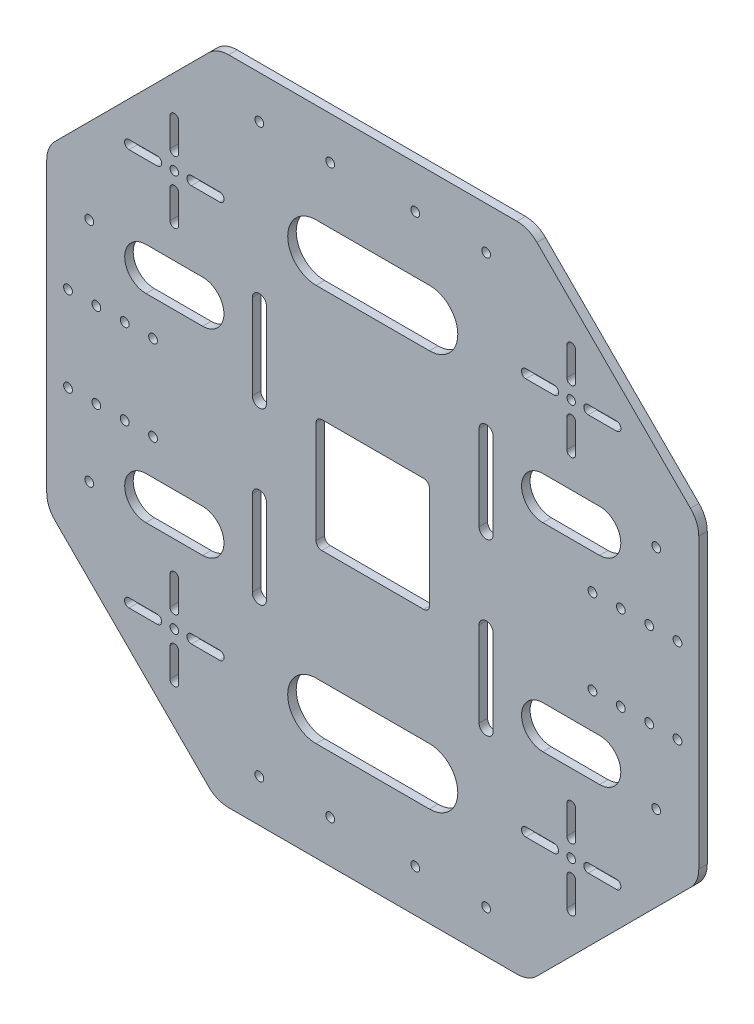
from build123d import *

# Parameters (mm, degrees)
SKETCH_1_R                         = 1.55
EXTRUDE_1_DEPTH                    = 3
SKETCH_3_R                         = 1.55
CUT_EXTRUDE_1_DEPTH                = 714.309192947
FILLET_1_R                         = 10
SKETCH_5_R                         = 1.5
CUT_EXTRUDE_3_DEPTH                = 714.309192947
PATTERN_CIRCULAR_2_COUNT           = 4
PATTERN_CIRCULAR_1_COUNT           = 4
PATTERN_CIRCULAR_1_COPY_1_SKETCH_R = 1.5
PATTERN_CIRCULAR_1_COPY_1_DEPTH    = 714.309192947
PATTERN_CIRCULAR_1_COPY_2_SKETCH_R = 1.5
PATTERN_CIRCULAR_1_COPY_2_DEPTH    = 714.309192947
PATTERN_CIRCULAR_1_COPY_3_SKETCH_R = 1.5
PATTERN_CIRCULAR_1_COPY_3_DEPTH    = 714.309192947
PATTERN_CIRCULAR_1_COPY_4_SKETCH_R = 1.5
PATTERN_CIRCULAR_1_COPY_4_DEPTH    = 714.309192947
PATTERN_CIRCULAR_1_COPY_5_SKETCH_R = 1.5
PATTERN_CIRCULAR_1_COPY_5_DEPTH    = 714.309192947
PATTERN_CIRCULAR_1_COPY_6_SKETCH_R = 1.5
PATTERN_CIRCULAR_1_COPY_6_DEPTH    = 714.309192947
PATTERN_CIRCULAR_1_COPY_7_SKETCH_R = 1.5
PATTERN_CIRCULAR_1_COPY_7_DEPTH    = 714.309192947
PATTERN_CIRCULAR_1_COPY_8_SKETCH_R = 1.5
PATTERN_CIRCULAR_1_COPY_8_DEPTH    = 714.309192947
PATTERN_CIRCULAR_1_COPY_9_SKETCH_R = 1.5
PATTERN_CIRCULAR_1_COPY_9_DEPTH    = 714.309192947
CUT_EXTRUDE_4_DEPTH                = 714.309192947
CUT_EXTRUDE_6_DEPTH                = 714.309192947
CUT_EXTRUDE_7_DEPTH                = 714.309192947
SKETCH_11_R                        = 1.55
CUT_EXTRUDE_9_DEPTH                = 714.309192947


with BuildPart() as part:
    # Sketch 1 → Extrude 1 (new body)
    with BuildSketch(Plane.XY):
        Polygon((463.239919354, 107.986365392), (523.239919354, 167.986365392), (633.239919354, 167.986365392), (693.239919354, 107.986365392), (693.239919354, -2.013634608), (633.239919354, -62.013634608), (523.239919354, -62.013634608), (463.239919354, -2.013634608), align=None)
        with Locations((538.239919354, 152.986365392)):
            Circle(SKETCH_1_R, mode=Mode.SUBTRACT)
        with Locations((618.239919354, 152.986365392)):
            Circle(SKETCH_1_R, mode=Mode.SUBTRACT)
        with Locations((678.239919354, 92.986365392)):
            Circle(SKETCH_1_R, mode=Mode.SUBTRACT)
        with Locations((678.239919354, 12.986365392)):
            Circle(SKETCH_1_R, mode=Mode.SUBTRACT)
        with Locations((618.239919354, -47.013634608)):
            Circle(SKETCH_1_R, mode=Mode.SUBTRACT)
        with Locations((538.239919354, -47.013634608)):
            Circle(SKETCH_1_R, mode=Mode.SUBTRACT)
        with Locations((478.239919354, 12.986365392)):
            Circle(SKETCH_1_R, mode=Mode.SUBTRACT)
        with Locations((478.239919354, 92.986365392)):
            Circle(SKETCH_1_R, mode=Mode.SUBTRACT)
    extrude(amount=EXTRUDE_1_DEPTH)

    # Sketch 3 → Cut-Extrude 1 (cut, through all)
    with BuildSketch(Plane.XY.offset(3)):
        with BuildLine():
            Line((540.739919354, 7.986365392), (540.739919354, 37.986365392))
            ThreePointArc((540.739919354, 37.986365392), (538.239919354, 40.486365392), (535.739919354, 37.986365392))
            Line((535.739919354, 37.986365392), (535.739919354, 7.986365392))
            ThreePointArc((535.739919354, 7.986365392), (538.239919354, 5.486365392), (540.739919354, 7.986365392))
        make_face()
        with BuildLine():
            Line((540.739919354, 67.986365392), (540.739919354, 97.986365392))
            ThreePointArc((540.739919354, 97.986365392), (538.239919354, 100.486365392), (535.739919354, 97.986365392))
            Line((535.739919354, 97.986365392), (535.739919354, 67.986365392))
            ThreePointArc((535.739919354, 67.986365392), (538.239919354, 65.486365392), (540.739919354, 67.986365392))
        make_face()
        with Locations((470.739919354, 67.986365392)):
            Circle(SKETCH_3_R)
        with Locations((470.739919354, 37.986365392)):
            Circle(SKETCH_3_R)
        with Locations((480.739919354, 67.986365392)):
            Circle(SKETCH_3_R)
        with Locations((480.739919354, 37.986365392)):
            Circle(SKETCH_3_R)
        with Locations((490.739919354, 67.986365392)):
            Circle(SKETCH_3_R)
        with Locations((490.739919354, 37.986365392)):
            Circle(SKETCH_3_R)
        with Locations((500.739919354, 67.986365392)):
            Circle(SKETCH_3_R)
        with Locations((500.739919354, 37.986365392)):
            Circle(SKETCH_3_R)
    cut_extrude_1 = extrude(amount=-CUT_EXTRUDE_1_DEPTH, mode=Mode.SUBTRACT)

    # Fillet 1
    fillet_1_edges = [part.edges().sort_by_distance(p)[0] for p in [
        (633.239919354, 167.986365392, 1.5),
        (693.239919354, 107.986365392, 1.5),
        (693.239919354, -2.013634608, 1.5),
        (633.239919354, -62.013634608, 1.5),
        (523.239919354, -62.013634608, 1.5),
        (463.239919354, -2.013634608, 1.5),
        (463.239919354, 107.986365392, 1.5),
        (523.239919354, 167.986365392, 1.5),
    ]]
    fillet(fillet_1_edges, radius=FILLET_1_R)

    # Sketch 5 → Cut-Extrude 3 (cut, through all)
    with BuildSketch(Plane.XY.offset(3)):
        with Locations((508.239919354, 122.986365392)):
            Circle(SKETCH_5_R)
        with BuildLine():
            Line((514.239919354, 124.536365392), (524.239919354, 124.536365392))
            ThreePointArc((524.239919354, 124.536365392), (525.789919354, 122.986365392), (524.239919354, 121.436365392))
            Line((524.239919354, 121.436365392), (514.239919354, 121.436365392))
            ThreePointArc((514.239919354, 121.436365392), (512.689919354, 122.986365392), (514.239919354, 124.536365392))
        make_face()
    cut_extrude_3 = extrude(amount=-CUT_EXTRUDE_3_DEPTH, mode=Mode.SUBTRACT)

    # Pattern Circular 2: Cut-Extrude 3 ×4 about axis
    pattern_circular_2_axis = Axis((508.239919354, 122.986365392, 0), (0, 0, 1))
    for i in range(1, PATTERN_CIRCULAR_2_COUNT):
        add(cut_extrude_3.rotate(pattern_circular_2_axis, i * 360 / PATTERN_CIRCULAR_2_COUNT), mode=Mode.SUBTRACT)

    # Pattern Circular 1: Cut-Extrude 3 ×4 about axis
    pattern_circular_1_axis = Axis((578.239919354, 52.986365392, 0), (0, 0, 1))
    for i in range(1, PATTERN_CIRCULAR_1_COUNT):
        add(cut_extrude_3.rotate(pattern_circular_1_axis, i * 360 / PATTERN_CIRCULAR_1_COUNT), mode=Mode.SUBTRACT)

    # Pattern Circular 1 copy 1 sketch → Pattern Circular 1 copy 1 (cut, through all)
    with BuildSketch(Plane(origin=(1016.479838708, 105.972730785, 3), x_dir=(-1, 0, 0), z_dir=(0, 0, 1))):
        with Locations((508.239919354, 122.986365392)):
            Circle(PATTERN_CIRCULAR_1_COPY_1_SKETCH_R)
        with BuildLine():
            Line((514.239919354, 124.536365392), (524.239919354, 124.536365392))
            ThreePointArc((524.239919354, 124.536365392), (525.789919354, 122.986365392), (524.239919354, 121.436365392))
            Line((524.239919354, 121.436365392), (514.239919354, 121.436365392))
            ThreePointArc((514.239919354, 121.436365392), (512.689919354, 122.986365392), (514.239919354, 124.536365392))
        make_face()
    extrude(amount=-PATTERN_CIRCULAR_1_COPY_1_DEPTH, mode=Mode.SUBTRACT)

    # Pattern Circular 1 copy 2 sketch → Pattern Circular 1 copy 2 (cut, through all)
    with BuildSketch(Plane(origin=(525.253553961, 491.226284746, 3), x_dir=(0, -1, 0), z_dir=(0, 0, 1))):
        with Locations((508.239919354, 122.986365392)):
            Circle(PATTERN_CIRCULAR_1_COPY_2_SKETCH_R)
        with BuildLine():
            Line((514.239919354, 124.536365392), (524.239919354, 124.536365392))
            ThreePointArc((524.239919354, 124.536365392), (525.789919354, 122.986365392), (524.239919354, 121.436365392))
            Line((524.239919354, 121.436365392), (514.239919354, 121.436365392))
            ThreePointArc((514.239919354, 121.436365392), (512.689919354, 122.986365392), (514.239919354, 124.536365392))
        make_face()
    extrude(amount=-PATTERN_CIRCULAR_1_COPY_2_DEPTH, mode=Mode.SUBTRACT)

    # Pattern Circular 1 copy 3 sketch → Pattern Circular 1 copy 3 (cut, through all)
    with BuildSketch(Plane(origin=(140, 0, 3), x_dir=(1, 0, 0), z_dir=(0, 0, 1))):
        with Locations((508.239919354, 122.986365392)):
            Circle(PATTERN_CIRCULAR_1_COPY_3_SKETCH_R)
        with BuildLine():
            Line((514.239919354, 124.536365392), (524.239919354, 124.536365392))
            ThreePointArc((524.239919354, 124.536365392), (525.789919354, 122.986365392), (524.239919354, 121.436365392))
            Line((524.239919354, 121.436365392), (514.239919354, 121.436365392))
            ThreePointArc((514.239919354, 121.436365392), (512.689919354, 122.986365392), (514.239919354, 124.536365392))
        make_face()
    extrude(amount=-PATTERN_CIRCULAR_1_COPY_3_DEPTH, mode=Mode.SUBTRACT)

    # Pattern Circular 1 copy 4 sketch → Pattern Circular 1 copy 4 (cut, through all)
    with BuildSketch(Plane(origin=(385.253553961, 491.226284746, 3), x_dir=(0, -1, 0), z_dir=(0, 0, 1))):
        with Locations((508.239919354, 122.986365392)):
            Circle(PATTERN_CIRCULAR_1_COPY_4_SKETCH_R)
        with BuildLine():
            Line((514.239919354, 124.536365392), (524.239919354, 124.536365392))
            ThreePointArc((524.239919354, 124.536365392), (525.789919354, 122.986365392), (524.239919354, 121.436365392))
            Line((524.239919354, 121.436365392), (514.239919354, 121.436365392))
            ThreePointArc((514.239919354, 121.436365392), (512.689919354, 122.986365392), (514.239919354, 124.536365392))
        make_face()
    extrude(amount=-PATTERN_CIRCULAR_1_COPY_4_DEPTH, mode=Mode.SUBTRACT)

    # Pattern Circular 1 copy 5 sketch → Pattern Circular 1 copy 5 (cut, through all)
    with BuildSketch(Plane(origin=(140, -140, 3), x_dir=(1, 0, 0), z_dir=(0, 0, 1))):
        with Locations((508.239919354, 122.986365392)):
            Circle(PATTERN_CIRCULAR_1_COPY_5_SKETCH_R)
        with BuildLine():
            Line((514.239919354, 124.536365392), (524.239919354, 124.536365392))
            ThreePointArc((524.239919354, 124.536365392), (525.789919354, 122.986365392), (524.239919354, 121.436365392))
            Line((524.239919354, 121.436365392), (514.239919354, 121.436365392))
            ThreePointArc((514.239919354, 121.436365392), (512.689919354, 122.986365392), (514.239919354, 124.536365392))
        make_face()
    extrude(amount=-PATTERN_CIRCULAR_1_COPY_5_DEPTH, mode=Mode.SUBTRACT)

    # Pattern Circular 1 copy 6 sketch → Pattern Circular 1 copy 6 (cut, through all)
    with BuildSketch(Plane(origin=(771.226284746, -385.253553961, 3), x_dir=(0, 1, 0), z_dir=(0, 0, 1))):
        with Locations((508.239919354, 122.986365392)):
            Circle(PATTERN_CIRCULAR_1_COPY_6_SKETCH_R)
        with BuildLine():
            Line((514.239919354, 124.536365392), (524.239919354, 124.536365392))
            ThreePointArc((524.239919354, 124.536365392), (525.789919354, 122.986365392), (524.239919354, 121.436365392))
            Line((524.239919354, 121.436365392), (514.239919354, 121.436365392))
            ThreePointArc((514.239919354, 121.436365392), (512.689919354, 122.986365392), (514.239919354, 124.536365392))
        make_face()
    extrude(amount=-PATTERN_CIRCULAR_1_COPY_6_DEPTH, mode=Mode.SUBTRACT)

    # Pattern Circular 1 copy 7 sketch → Pattern Circular 1 copy 7 (cut, through all)
    with BuildSketch(Plane(origin=(0, -140, 3), x_dir=(1, 0, 0), z_dir=(0, 0, 1))):
        with Locations((508.239919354, 122.986365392)):
            Circle(PATTERN_CIRCULAR_1_COPY_7_SKETCH_R)
        with BuildLine():
            Line((514.239919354, 124.536365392), (524.239919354, 124.536365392))
            ThreePointArc((524.239919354, 124.536365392), (525.789919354, 122.986365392), (524.239919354, 121.436365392))
            Line((524.239919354, 121.436365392), (514.239919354, 121.436365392))
            ThreePointArc((514.239919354, 121.436365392), (512.689919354, 122.986365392), (514.239919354, 124.536365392))
        make_face()
    extrude(amount=-PATTERN_CIRCULAR_1_COPY_7_DEPTH, mode=Mode.SUBTRACT)

    # Pattern Circular 1 copy 8 sketch → Pattern Circular 1 copy 8 (cut, through all)
    with BuildSketch(Plane(origin=(771.226284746, -525.253553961, 3), x_dir=(0, 1, 0), z_dir=(0, 0, 1))):
        with Locations((508.239919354, 122.986365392)):
            Circle(PATTERN_CIRCULAR_1_COPY_8_SKETCH_R)
        with BuildLine():
            Line((514.239919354, 124.536365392), (524.239919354, 124.536365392))
            ThreePointArc((524.239919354, 124.536365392), (525.789919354, 122.986365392), (524.239919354, 121.436365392))
            Line((524.239919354, 121.436365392), (514.239919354, 121.436365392))
            ThreePointArc((514.239919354, 121.436365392), (512.689919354, 122.986365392), (514.239919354, 124.536365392))
        make_face()
    extrude(amount=-PATTERN_CIRCULAR_1_COPY_8_DEPTH, mode=Mode.SUBTRACT)

    # Pattern Circular 1 copy 9 sketch → Pattern Circular 1 copy 9 (cut, through all)
    with BuildSketch(Plane(origin=(1156.479838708, 245.972730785, 3), x_dir=(-1, 0, 0), z_dir=(0, 0, 1))):
        with Locations((508.239919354, 122.986365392)):
            Circle(PATTERN_CIRCULAR_1_COPY_9_SKETCH_R)
        with BuildLine():
            Line((514.239919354, 124.536365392), (524.239919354, 124.536365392))
            ThreePointArc((524.239919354, 124.536365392), (525.789919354, 122.986365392), (524.239919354, 121.436365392))
            Line((524.239919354, 121.436365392), (514.239919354, 121.436365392))
            ThreePointArc((514.239919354, 121.436365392), (512.689919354, 122.986365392), (514.239919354, 124.536365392))
        make_face()
    extrude(amount=-PATTERN_CIRCULAR_1_COPY_9_DEPTH, mode=Mode.SUBTRACT)

    # Mirror 1: Cut-Extrude 1 across plane
    add(cut_extrude_1.mirror(Plane(origin=(578.239919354, 0, 0), x_dir=(0, 0, 1), z_dir=(1, 0, 0))), mode=Mode.SUBTRACT)

    # Sketch 6 → Cut-Extrude 4 (cut, through all)
    with BuildSketch(Plane.XY.offset(3)):
        with BuildLine():
            Line((560.239919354, 72.986365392), (596.239919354, 72.986365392))
            ThreePointArc((596.239919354, 72.986365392), (597.654132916, 72.400578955), (598.239919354, 70.986365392))
            Line((598.239919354, 70.986365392), (598.239919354, 34.986365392))
            ThreePointArc((598.239919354, 34.986365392), (597.654132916, 33.57215183), (596.239919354, 32.986365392))
            Line((596.239919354, 32.986365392), (560.239919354, 32.986365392))
            ThreePointArc((560.239919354, 32.986365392), (558.825705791, 33.57215183), (558.239919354, 34.986365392))
            Line((558.239919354, 34.986365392), (558.239919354, 70.986365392))
            ThreePointArc((558.239919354, 70.986365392), (558.825705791, 72.400578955), (560.239919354, 72.986365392))
        make_face()
    extrude(amount=-CUT_EXTRUDE_4_DEPTH, mode=Mode.SUBTRACT)

    # Sketch 10 → Cut-Extrude 6 (cut, through all)
    with BuildSketch(Plane.XY.offset(3)):
        with BuildLine():
            Line((558.239919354, 132.986365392), (598.239919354, 132.986365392))
            ThreePointArc((598.239919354, 132.986365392), (608.239919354, 122.986365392), (598.239919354, 112.986365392))
            Line((598.239919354, 112.986365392), (558.239919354, 112.986365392))
            ThreePointArc((558.239919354, 112.986365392), (548.239919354, 122.986365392), (558.239919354, 132.986365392))
        make_face()
    cut_extrude_6 = extrude(amount=-CUT_EXTRUDE_6_DEPTH, mode=Mode.SUBTRACT)

    # Mirror 2: Cut-Extrude 6 across plane
    add(cut_extrude_6.mirror(Plane.ZX.offset(52.986365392)), mode=Mode.SUBTRACT)

    # Sketch 4 → Cut-Extrude 7 (cut, through all)
    with BuildSketch(Plane.XY.offset(3)):
        with BuildLine():
            Line((518.239919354, 10.486365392), (498.239919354, 10.486365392))
            ThreePointArc((498.239919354, 10.486365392), (490.739919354, 17.986365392), (498.239919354, 25.486365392))
            Line((498.239919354, 25.486365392), (518.239919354, 25.486365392))
            ThreePointArc((518.239919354, 25.486365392), (525.739919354, 17.986365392), (518.239919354, 10.486365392))
        make_face()
        with BuildLine():
            Line((518.239919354, 80.486365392), (498.239919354, 80.486365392))
            ThreePointArc((498.239919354, 80.486365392), (490.739919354, 87.986365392), (498.239919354, 95.486365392))
            Line((498.239919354, 95.486365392), (518.239919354, 95.486365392))
            ThreePointArc((518.239919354, 95.486365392), (525.739919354, 87.986365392), (518.239919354, 80.486365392))
        make_face()
        with BuildLine():
            Line((658.239919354, 80.486365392), (638.239919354, 80.486365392))
            ThreePointArc((638.239919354, 80.486365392), (630.739919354, 87.986365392), (638.239919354, 95.486365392))
            Line((638.239919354, 95.486365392), (658.239919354, 95.486365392))
            ThreePointArc((658.239919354, 95.486365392), (665.739919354, 87.986365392), (658.239919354, 80.486365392))
        make_face()
        with BuildLine():
            Line((658.239919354, 10.486365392), (638.239919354, 10.486365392))
            ThreePointArc((638.239919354, 10.486365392), (630.739919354, 17.986365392), (638.239919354, 25.486365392))
            Line((638.239919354, 25.486365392), (658.239919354, 25.486365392))
            ThreePointArc((658.239919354, 25.486365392), (665.739919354, 17.986365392), (658.239919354, 10.486365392))
        make_face()
    extrude(amount=-CUT_EXTRUDE_7_DEPTH, mode=Mode.SUBTRACT)

    # Sketch 11 → Cut-Extrude 9 (cut, through all)
    with BuildSketch(Plane.XY.offset(3)):
        with Locations((593.239919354, 152.986365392)):
            Circle(SKETCH_11_R)
        with Locations((563.239919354, 152.986365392)):
            Circle(SKETCH_11_R)
        with Locations((593.239919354, -47.013634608)):
            Circle(SKETCH_11_R)
        with Locations((563.239919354, -47.013634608)):
            Circle(SKETCH_11_R)
    extrude(amount=-CUT_EXTRUDE_9_DEPTH, mode=Mode.SUBTRACT)


solid = part.part
